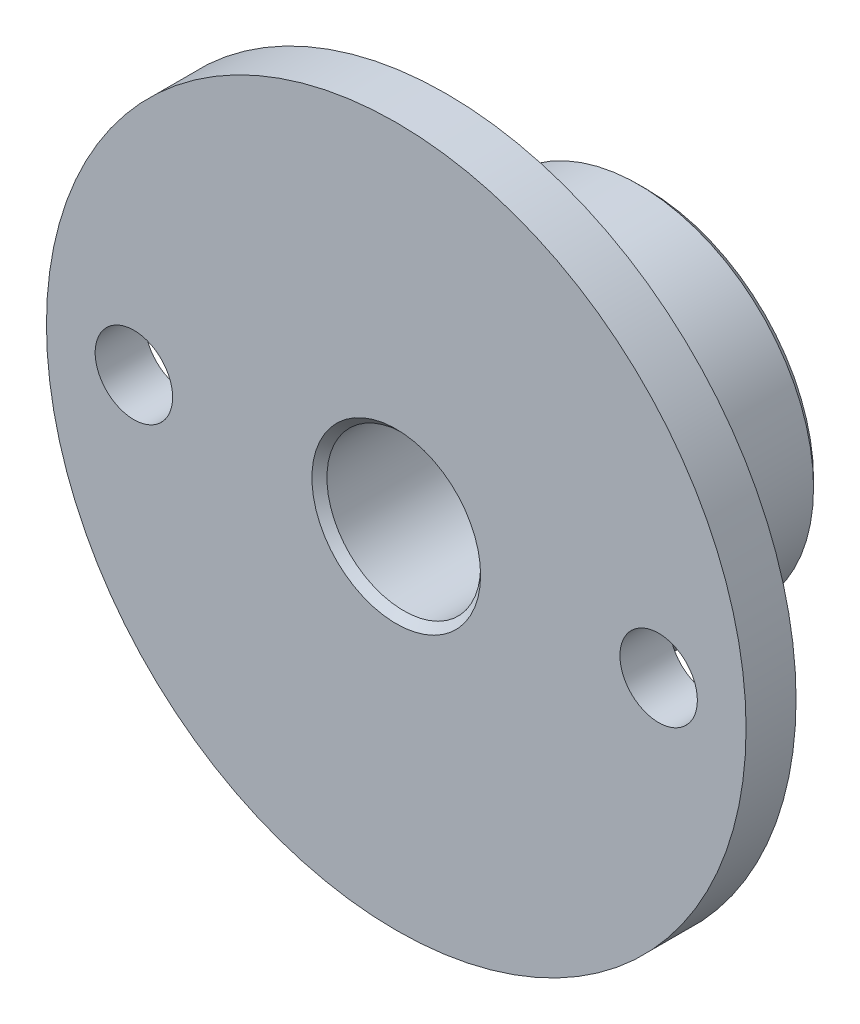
ISO-10303-21;
HEADER;
FILE_DESCRIPTION(('STEP AP214'),'2;1');
FILE_NAME('part.step','',(''),(''),'','','');
FILE_SCHEMA(('AUTOMOTIVE_DESIGN { 1 0 10303 214 1 1 1 1 }'));
ENDSEC;
DATA;
#1=APPLICATION_CONTEXT('core data for automotive mechanical design processes');
#2=APPLICATION_PROTOCOL_DEFINITION('international standard','automotive_design',2000,#1);
#3=PRODUCT_CONTEXT('',#1,'mechanical');
#4=PRODUCT('Part','Part','',(#3));
#5=PRODUCT_RELATED_PRODUCT_CATEGORY('part','',(#4));
#6=PRODUCT_DEFINITION_FORMATION('','',#4);
#7=PRODUCT_DEFINITION_CONTEXT('part definition',#1,'design');
#8=PRODUCT_DEFINITION('design','',#6,#7);
#9=PRODUCT_DEFINITION_SHAPE('','',#8);
#10=(LENGTH_UNIT() NAMED_UNIT(*) SI_UNIT(.MILLI.,.METRE.));
#11=(NAMED_UNIT(*) PLANE_ANGLE_UNIT() SI_UNIT($,.RADIAN.));
#12=(NAMED_UNIT(*) SI_UNIT($,.STERADIAN.) SOLID_ANGLE_UNIT());
#13=UNCERTAINTY_MEASURE_WITH_UNIT(LENGTH_MEASURE(1.E-05),#10,'distance_accuracy_value','');
#14=(GEOMETRIC_REPRESENTATION_CONTEXT(3) GLOBAL_UNCERTAINTY_ASSIGNED_CONTEXT((#13)) GLOBAL_UNIT_ASSIGNED_CONTEXT((#10,
#11,#12)) REPRESENTATION_CONTEXT('',''));
#15=CARTESIAN_POINT('',(0.,0.,0.));
#16=DIRECTION('',(0.,0.,1.));
#17=DIRECTION('',(1.,0.,0.));
#18=AXIS2_PLACEMENT_3D('',#15,#16,#17);
#19=CARTESIAN_POINT('',(0.,0.,8.));
#20=DIRECTION('',(0.,0.,-1.));
#21=DIRECTION('',(-1.,0.,0.));
#22=AXIS2_PLACEMENT_3D('',#19,#20,#21);
#23=CYLINDRICAL_SURFACE('',#22,7.);
#24=CARTESIAN_POINT('',(0.,0.,0.300000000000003));
#25=DIRECTION('',(0.,0.,1.));
#26=DIRECTION('',(1.,0.,0.));
#27=AXIS2_PLACEMENT_3D('',#24,#25,#26);
#28=CIRCLE('',#27,7.);
#29=CARTESIAN_POINT('',(7.,0.,0.300000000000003));
#30=VERTEX_POINT('',#29);
#31=EDGE_CURVE('E46',#30,#30,#28,.T.);
#32=ORIENTED_EDGE('',*,*,#31,.T.);
#33=EDGE_LOOP('',(#32));
#34=FACE_BOUND('',#33,.T.);
#35=CARTESIAN_POINT('',(0.,-7.,5.25));
#36=CARTESIAN_POINT('',(0.0696197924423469,-6.99999876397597,5.24999727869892));
#37=CARTESIAN_POINT('',(0.139275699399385,-6.99895060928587,5.24416404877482));
#38=CARTESIAN_POINT('',(0.276628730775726,-6.99487029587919,5.22099791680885));
#39=CARTESIAN_POINT('',(0.344324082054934,-6.99183639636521,5.20365492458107));
#40=CARTESIAN_POINT('',(0.475749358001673,-6.98412437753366,5.15801388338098));
#41=CARTESIAN_POINT('',(0.539482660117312,-6.97944768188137,5.1297253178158));
#42=CARTESIAN_POINT('',(0.661291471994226,-6.96896231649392,5.06302215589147));
#43=CARTESIAN_POINT('',(0.719367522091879,-6.96315375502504,5.02460852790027));
#44=CARTESIAN_POINT('',(0.828853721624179,-6.95097616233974,4.93830039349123));
#45=CARTESIAN_POINT('',(0.880193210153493,-6.94460221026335,4.89031693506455));
#46=CARTESIAN_POINT('',(0.974138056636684,-6.93204924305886,4.78642262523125));
#47=CARTESIAN_POINT('',(1.01674282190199,-6.92587024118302,4.73051123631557));
#48=CARTESIAN_POINT('',(1.09229802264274,-6.91435905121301,4.61185494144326));
#49=CARTESIAN_POINT('',(1.1251774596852,-6.90903321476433,4.54906415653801));
#50=CARTESIAN_POINT('',(1.17989439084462,-6.89990026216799,4.41873942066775));
#51=CARTESIAN_POINT('',(1.20173274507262,-6.89609302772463,4.35120583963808));
#52=CARTESIAN_POINT('',(1.23352263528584,-6.89047765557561,4.21406558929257));
#53=CARTESIAN_POINT('',(1.24359686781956,-6.88864889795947,4.1444882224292));
#54=CARTESIAN_POINT('',(1.25195320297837,-6.88713528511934,4.00460853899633));
#55=CARTESIAN_POINT('',(1.25023626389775,-6.88745025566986,3.93430628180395));
#56=CARTESIAN_POINT('',(1.23515868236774,-6.89016971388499,3.79585555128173));
#57=CARTESIAN_POINT('',(1.22193680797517,-6.8925492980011,3.72769140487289));
#58=CARTESIAN_POINT('',(1.18444287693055,-6.89909080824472,3.59456468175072));
#59=CARTESIAN_POINT('',(1.16017039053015,-6.90325280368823,3.52960222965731));
#60=CARTESIAN_POINT('',(1.1011263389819,-6.9129166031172,3.40431276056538));
#61=CARTESIAN_POINT('',(1.06629803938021,-6.91842561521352,3.34401305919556));
#62=CARTESIAN_POINT('',(0.987171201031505,-6.93015785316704,3.23006124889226));
#63=CARTESIAN_POINT('',(0.942871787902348,-6.93638114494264,3.17640975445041));
#64=CARTESIAN_POINT('',(0.845308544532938,-6.94894965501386,3.07647489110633));
#65=CARTESIAN_POINT('',(0.79192585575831,-6.95529534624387,3.03030754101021));
#66=CARTESIAN_POINT('',(0.678111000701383,-6.96731186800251,2.94756693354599));
#67=CARTESIAN_POINT('',(0.617678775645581,-6.97298269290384,2.91099375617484));
#68=CARTESIAN_POINT('',(0.491364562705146,-6.98302041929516,2.84846548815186));
#69=CARTESIAN_POINT('',(0.425476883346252,-6.98738593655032,2.82252165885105));
#70=CARTESIAN_POINT('',(0.290183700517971,-6.99431030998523,2.78210155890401));
#71=CARTESIAN_POINT('',(0.220778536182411,-6.99686933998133,2.76762418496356));
#72=CARTESIAN_POINT('',(0.0814194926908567,-6.9998687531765,2.75070757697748));
#73=CARTESIAN_POINT('',(0.0114855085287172,-7.00033713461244,2.74810924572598));
#74=CARTESIAN_POINT('',(-0.127817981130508,-6.99917952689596,2.75459886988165));
#75=CARTESIAN_POINT('',(-0.197187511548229,-6.99755363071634,2.76368630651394));
#76=CARTESIAN_POINT('',(-0.332894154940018,-6.99240754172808,2.79315719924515));
#77=CARTESIAN_POINT('',(-0.399249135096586,-6.98890072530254,2.81346091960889));
#78=CARTESIAN_POINT('',(-0.52761333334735,-6.98038436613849,2.86470231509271));
#79=CARTESIAN_POINT('',(-0.589622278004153,-6.97537472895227,2.8956406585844));
#80=CARTESIAN_POINT('',(-0.708218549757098,-6.96433866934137,2.96763061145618));
#81=CARTESIAN_POINT('',(-0.764745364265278,-6.95830256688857,3.0087803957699));
#82=CARTESIAN_POINT('',(-0.870148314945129,-6.94590984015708,3.09989132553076));
#83=CARTESIAN_POINT('',(-0.919023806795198,-6.93955318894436,3.14985321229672));
#84=CARTESIAN_POINT('',(-1.00833474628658,-6.92714394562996,3.25788748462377));
#85=CARTESIAN_POINT('',(-1.04866208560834,-6.92109590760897,3.31604985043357));
#86=CARTESIAN_POINT('',(-1.118974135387,-6.91007733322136,3.4384168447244));
#87=CARTESIAN_POINT('',(-1.14895920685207,-6.90510675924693,3.50262126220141));
#88=CARTESIAN_POINT('',(-1.19757853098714,-6.89684095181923,3.63496308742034));
#89=CARTESIAN_POINT('',(-1.21626421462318,-6.89353813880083,3.70308110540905));
#90=CARTESIAN_POINT('',(-1.24191447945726,-6.88896372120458,3.84155364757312));
#91=CARTESIAN_POINT('',(-1.24888024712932,-6.88769191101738,3.91190794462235));
#92=CARTESIAN_POINT('',(-1.25085614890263,-6.88733324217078,4.05177460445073));
#93=CARTESIAN_POINT('',(-1.24603664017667,-6.88821524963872,4.12128453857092));
#94=CARTESIAN_POINT('',(-1.22494973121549,-6.89199615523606,4.25848690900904));
#95=CARTESIAN_POINT('',(-1.20868238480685,-6.89489504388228,4.32617935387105));
#96=CARTESIAN_POINT('',(-1.16523056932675,-6.90237052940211,4.45774493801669));
#97=CARTESIAN_POINT('',(-1.13806288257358,-6.9069445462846,4.52162377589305));
#98=CARTESIAN_POINT('',(-1.07359967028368,-6.91725701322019,4.64394421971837));
#99=CARTESIAN_POINT('',(-1.03630352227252,-6.92299553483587,4.7023854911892));
#100=CARTESIAN_POINT('',(-0.952042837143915,-6.93508798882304,4.81302852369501));
#101=CARTESIAN_POINT('',(-0.904953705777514,-6.94144922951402,4.86513461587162));
#102=CARTESIAN_POINT('',(-0.802704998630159,-6.95401412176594,4.96076290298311));
#103=CARTESIAN_POINT('',(-0.747543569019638,-6.9602177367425,5.00428312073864));
#104=CARTESIAN_POINT('',(-0.630185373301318,-6.9718267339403,5.08182888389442));
#105=CARTESIAN_POINT('',(-0.56793551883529,-6.97722528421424,5.1157751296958));
#106=CARTESIAN_POINT('',(-0.438542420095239,-6.98654935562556,5.17267460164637));
#107=CARTESIAN_POINT('',(-0.371403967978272,-6.99047629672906,5.19563843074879));
#108=CARTESIAN_POINT('',(-0.253365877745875,-6.99558898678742,5.22511530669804));
#109=CARTESIAN_POINT('',(-0.203167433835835,-6.99723399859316,5.23443156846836));
#110=CARTESIAN_POINT('',(-0.10198577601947,-6.99943994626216,5.24687484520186));
#111=CARTESIAN_POINT('',(-0.0510025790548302,-7.00000090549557,5.25000199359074));
#112=CARTESIAN_POINT('',(0.,-7.,5.25));
#113=B_SPLINE_CURVE_WITH_KNOTS('',3,(#35,#36,#37,#38,#39,#40,#41,#42,#43,#44,#45,#46,#47,#48,
#49,#50,#51,#52,#53,#54,#55,#56,#57,#58,#59,#60,#61,#62,#63,#64,#65,#66,#67,#68,#69,#70,#71,#72,
#73,#74,#75,#76,#77,#78,#79,#80,#81,#82,#83,#84,#85,#86,#87,#88,#89,#90,#91,#92,#93,#94,#95,#96,
#97,#98,#99,#100,#101,#102,#103,#104,#105,#106,#107,#108,#109,#110,#111,#112),.UNSPECIFIED.,.T.,
.F.,(4,2,2,2,2,2,2,2,2,2,2,2,2,2,2,2,2,2,2,2,2,2,2,2,2,2,2,2,2,2,2,2,2,2,2,2,2,2,4),(0.,
0.208672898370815,0.417528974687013,0.626204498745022,0.834860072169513,1.04555398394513,
1.2562621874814,1.46847268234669,1.68066664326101,1.89062713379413,2.10057056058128,
2.30801629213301,2.51547009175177,2.72405928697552,2.93266774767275,3.14425188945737,
3.35583779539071,3.56764729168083,3.77943640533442,3.98838053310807,4.1973153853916,
4.40478370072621,4.61226505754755,4.82182420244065,5.03140098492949,5.24348810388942,
5.45556781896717,5.66667480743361,5.87776042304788,6.08581286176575,6.29386432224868,
6.50159668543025,6.70934181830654,6.91991234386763,7.13053130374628,7.34284672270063,
7.5549567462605,7.70783116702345,7.8607022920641),.UNSPECIFIED.);
#114=CARTESIAN_POINT('',(0.,-7.,5.25));
#115=VERTEX_POINT('',#114);
#116=EDGE_CURVE('E69',#115,#115,#113,.T.);
#117=ORIENTED_EDGE('',*,*,#116,.T.);
#118=EDGE_LOOP('',(#117));
#119=FACE_BOUND('',#118,.T.);
#120=CARTESIAN_POINT('',(0.,0.,8.));
#121=DIRECTION('',(0.,0.,1.));
#122=DIRECTION('',(1.,0.,0.));
#123=AXIS2_PLACEMENT_3D('',#120,#121,#122);
#124=CIRCLE('',#123,7.);
#125=CARTESIAN_POINT('',(7.,0.,8.));
#126=VERTEX_POINT('',#125);
#127=EDGE_CURVE('E61',#126,#126,#124,.T.);
#128=ORIENTED_EDGE('',*,*,#127,.F.);
#129=EDGE_LOOP('',(#128));
#130=FACE_BOUND('',#129,.T.);
#131=ADVANCED_FACE('F35',(#34,#119,#130),#23,.T.);
#132=CARTESIAN_POINT('',(0.,0.,0.));
#133=DIRECTION('',(0.,0.,1.));
#134=DIRECTION('',(1.,0.,0.));
#135=AXIS2_PLACEMENT_3D('',#132,#133,#134);
#136=PLANE('',#135);
#137=CARTESIAN_POINT('',(0.,0.,0.));
#138=DIRECTION('',(0.,0.,1.));
#139=DIRECTION('',(1.,0.,0.));
#140=AXIS2_PLACEMENT_3D('',#137,#138,#139);
#141=CIRCLE('',#140,6.7);
#142=CARTESIAN_POINT('',(6.7,0.,0.));
#143=VERTEX_POINT('',#142);
#144=EDGE_CURVE('E10',#143,#143,#141,.F.);
#145=ORIENTED_EDGE('',*,*,#144,.T.);
#146=EDGE_LOOP('',(#145));
#147=FACE_BOUND('',#146,.T.);
#148=CARTESIAN_POINT('',(0.,0.,0.));
#149=DIRECTION('',(0.,0.,1.));
#150=DIRECTION('',(1.,0.,0.));
#151=AXIS2_PLACEMENT_3D('',#148,#149,#150);
#152=CIRCLE('',#151,3.375);
#153=CARTESIAN_POINT('',(3.375,0.,0.));
#154=VERTEX_POINT('',#153);
#155=EDGE_CURVE('E42',#154,#154,#152,.T.);
#156=ORIENTED_EDGE('',*,*,#155,.T.);
#157=EDGE_LOOP('',(#156));
#158=FACE_BOUND('',#157,.T.);
#159=ADVANCED_FACE('F95',(#147,#158),#136,.F.);
#160=CARTESIAN_POINT('',(0.,0.,8.));
#161=DIRECTION('',(0.,0.,1.));
#162=DIRECTION('',(1.,0.,0.));
#163=AXIS2_PLACEMENT_3D('',#160,#161,#162);
#164=PLANE('',#163);
#165=CARTESIAN_POINT('',(10.5,0.,8.));
#166=DIRECTION('',(0.,0.,1.));
#167=DIRECTION('',(1.,0.,0.));
#168=AXIS2_PLACEMENT_3D('',#165,#166,#167);
#169=CIRCLE('',#168,1.55);
#170=CARTESIAN_POINT('',(12.05,0.,8.));
#171=VERTEX_POINT('',#170);
#172=EDGE_CURVE('E128',#171,#171,#169,.T.);
#173=ORIENTED_EDGE('',*,*,#172,.T.);
#174=EDGE_LOOP('',(#173));
#175=FACE_BOUND('',#174,.T.);
#176=CARTESIAN_POINT('',(-10.5,0.,8.));
#177=DIRECTION('',(0.,0.,1.));
#178=DIRECTION('',(1.,0.,0.));
#179=AXIS2_PLACEMENT_3D('',#176,#177,#178);
#180=CIRCLE('',#179,1.55);
#181=CARTESIAN_POINT('',(-8.95,0.,8.));
#182=VERTEX_POINT('',#181);
#183=EDGE_CURVE('E122',#182,#182,#180,.T.);
#184=ORIENTED_EDGE('',*,*,#183,.T.);
#185=EDGE_LOOP('',(#184));
#186=FACE_BOUND('',#185,.T.);
#187=CARTESIAN_POINT('',(0.,0.,8.));
#188=DIRECTION('',(0.,0.,1.));
#189=DIRECTION('',(1.,0.,0.));
#190=AXIS2_PLACEMENT_3D('',#187,#188,#189);
#191=CIRCLE('',#190,14.);
#192=CARTESIAN_POINT('',(14.,0.,8.));
#193=VERTEX_POINT('',#192);
#194=EDGE_CURVE('E117',#193,#193,#191,.T.);
#195=ORIENTED_EDGE('',*,*,#194,.F.);
#196=EDGE_LOOP('',(#195));
#197=FACE_BOUND('',#196,.T.);
#198=ORIENTED_EDGE('',*,*,#127,.T.);
#199=EDGE_LOOP('',(#198));
#200=FACE_BOUND('',#199,.T.);
#201=ADVANCED_FACE('F149',(#175,#186,#197,#200),#164,.F.);
#202=CARTESIAN_POINT('',(0.,0.,10.));
#203=DIRECTION('',(0.,0.,-1.));
#204=DIRECTION('',(-1.,0.,0.));
#205=AXIS2_PLACEMENT_3D('',#202,#203,#204);
#206=CYLINDRICAL_SURFACE('',#205,14.);
#207=CARTESIAN_POINT('',(0.,0.,10.));
#208=DIRECTION('',(0.,0.,1.));
#209=DIRECTION('',(1.,0.,0.));
#210=AXIS2_PLACEMENT_3D('',#207,#208,#209);
#211=CIRCLE('',#210,14.);
#212=CARTESIAN_POINT('',(14.,0.,10.));
#213=VERTEX_POINT('',#212);
#214=EDGE_CURVE('E115',#213,#213,#211,.T.);
#215=ORIENTED_EDGE('',*,*,#214,.F.);
#216=EDGE_LOOP('',(#215));
#217=FACE_BOUND('',#216,.T.);
#218=ORIENTED_EDGE('',*,*,#194,.T.);
#219=EDGE_LOOP('',(#218));
#220=FACE_BOUND('',#219,.T.);
#221=ADVANCED_FACE('F140',(#217,#220),#206,.T.);
#222=CARTESIAN_POINT('',(0.,0.,10.));
#223=DIRECTION('',(0.,0.,1.));
#224=DIRECTION('',(1.,0.,0.));
#225=AXIS2_PLACEMENT_3D('',#222,#223,#224);
#226=PLANE('',#225);
#227=CARTESIAN_POINT('',(0.,0.,10.));
#228=DIRECTION('',(0.,0.,1.));
#229=DIRECTION('',(1.,0.,0.));
#230=AXIS2_PLACEMENT_3D('',#227,#228,#229);
#231=CIRCLE('',#230,3.37500000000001);
#232=CARTESIAN_POINT('',(3.37500000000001,0.,10.));
#233=VERTEX_POINT('',#232);
#234=EDGE_CURVE('E50',#233,#233,#231,.F.);
#235=ORIENTED_EDGE('',*,*,#234,.T.);
#236=EDGE_LOOP('',(#235));
#237=FACE_BOUND('',#236,.T.);
#238=CARTESIAN_POINT('',(10.5,0.,10.));
#239=DIRECTION('',(0.,0.,1.));
#240=DIRECTION('',(1.,0.,0.));
#241=AXIS2_PLACEMENT_3D('',#238,#239,#240);
#242=CIRCLE('',#241,1.55);
#243=CARTESIAN_POINT('',(12.05,0.,10.));
#244=VERTEX_POINT('',#243);
#245=EDGE_CURVE('E89',#244,#244,#242,.T.);
#246=ORIENTED_EDGE('',*,*,#245,.F.);
#247=EDGE_LOOP('',(#246));
#248=FACE_BOUND('',#247,.T.);
#249=CARTESIAN_POINT('',(-10.5,0.,10.));
#250=DIRECTION('',(0.,0.,1.));
#251=DIRECTION('',(1.,0.,0.));
#252=AXIS2_PLACEMENT_3D('',#249,#250,#251);
#253=CIRCLE('',#252,1.55);
#254=CARTESIAN_POINT('',(-8.95,0.,10.));
#255=VERTEX_POINT('',#254);
#256=EDGE_CURVE('E126',#255,#255,#253,.T.);
#257=ORIENTED_EDGE('',*,*,#256,.F.);
#258=EDGE_LOOP('',(#257));
#259=FACE_BOUND('',#258,.T.);
#260=ORIENTED_EDGE('',*,*,#214,.T.);
#261=EDGE_LOOP('',(#260));
#262=FACE_BOUND('',#261,.T.);
#263=ADVANCED_FACE('F137',(#237,#248,#259,#262),#226,.T.);
#264=CARTESIAN_POINT('',(0.,0.,0.));
#265=DIRECTION('',(0.,0.,1.));
#266=DIRECTION('',(1.,0.,0.));
#267=AXIS2_PLACEMENT_3D('',#264,#265,#266);
#268=CYLINDRICAL_SURFACE('',#267,3.075);
#269=CARTESIAN_POINT('',(0.,0.,9.69999999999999));
#270=DIRECTION('',(0.,0.,1.));
#271=DIRECTION('',(1.,0.,0.));
#272=AXIS2_PLACEMENT_3D('',#269,#270,#271);
#273=CIRCLE('',#272,3.075);
#274=CARTESIAN_POINT('',(3.075,0.,9.69999999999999));
#275=VERTEX_POINT('',#274);
#276=EDGE_CURVE('E55',#275,#275,#273,.T.);
#277=ORIENTED_EDGE('',*,*,#276,.T.);
#278=EDGE_LOOP('',(#277));
#279=FACE_BOUND('',#278,.T.);
#280=CARTESIAN_POINT('',(0.,0.,0.300000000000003));
#281=DIRECTION('',(0.,0.,1.));
#282=DIRECTION('',(1.,0.,0.));
#283=AXIS2_PLACEMENT_3D('',#280,#281,#282);
#284=CIRCLE('',#283,3.075);
#285=CARTESIAN_POINT('',(3.075,0.,0.300000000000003));
#286=VERTEX_POINT('',#285);
#287=EDGE_CURVE('E58',#286,#286,#284,.F.);
#288=ORIENTED_EDGE('',*,*,#287,.T.);
#289=EDGE_LOOP('',(#288));
#290=FACE_BOUND('',#289,.T.);
#291=CARTESIAN_POINT('',(0.,-3.075,5.25));
#292=CARTESIAN_POINT('',(-0.0670960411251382,-3.07499507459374,5.24999338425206));
#293=CARTESIAN_POINT('',(-0.134304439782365,-3.07277831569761,5.24456556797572));
#294=CARTESIAN_POINT('',(-0.266822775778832,-3.06412620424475,5.22304401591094));
#295=CARTESIAN_POINT('',(-0.332127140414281,-3.05767955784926,5.20692172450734));
#296=CARTESIAN_POINT('',(-0.458705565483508,-3.04126163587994,5.16469875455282));
#297=CARTESIAN_POINT('',(-0.519992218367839,-3.03130206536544,5.13863119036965));
#298=CARTESIAN_POINT('',(-0.637265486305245,-3.00883490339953,5.07739105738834));
#299=CARTESIAN_POINT('',(-0.693253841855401,-2.99632815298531,5.04222149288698));
#300=CARTESIAN_POINT('',(-0.801130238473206,-2.969350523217,4.96198024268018));
#301=CARTESIAN_POINT('',(-0.85272874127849,-2.95481736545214,4.91654040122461));
#302=CARTESIAN_POINT('',(-0.947819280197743,-2.92570360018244,4.817826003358));
#303=CARTESIAN_POINT('',(-0.991307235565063,-2.91112297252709,4.76454752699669));
#304=CARTESIAN_POINT('',(-1.07092779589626,-2.88281270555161,4.64867452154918));
#305=CARTESIAN_POINT('',(-1.10662661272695,-2.8691537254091,4.58576286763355));
#306=CARTESIAN_POINT('',(-1.16680627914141,-2.84521438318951,4.45419044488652));
#307=CARTESIAN_POINT('',(-1.19129263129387,-2.83493236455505,4.38553251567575));
#308=CARTESIAN_POINT('',(-1.22717171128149,-2.81958182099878,4.24774611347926));
#309=CARTESIAN_POINT('',(-1.23911994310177,-2.81429325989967,4.17878772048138));
#310=CARTESIAN_POINT('',(-1.25131810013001,-2.80889252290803,4.03965760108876));
#311=CARTESIAN_POINT('',(-1.2515740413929,-2.80877768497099,3.9694865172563));
#312=CARTESIAN_POINT('',(-1.24080032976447,-2.81355023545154,3.8353349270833));
#313=CARTESIAN_POINT('',(-1.23058524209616,-2.81807658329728,3.77127363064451));
#314=CARTESIAN_POINT('',(-1.20052077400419,-2.83101392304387,3.64586829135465));
#315=CARTESIAN_POINT('',(-1.18066965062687,-2.83942561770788,3.58452474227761));
#316=CARTESIAN_POINT('',(-1.13151479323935,-2.8593727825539,3.46478868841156));
#317=CARTESIAN_POINT('',(-1.10202336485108,-2.87096948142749,3.40648389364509));
#318=CARTESIAN_POINT('',(-1.03455716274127,-2.89596416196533,3.295431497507));
#319=CARTESIAN_POINT('',(-0.996579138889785,-2.90936283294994,3.24268603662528));
#320=CARTESIAN_POINT('',(-0.909645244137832,-2.93775785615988,3.13980499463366));
#321=CARTESIAN_POINT('',(-0.860053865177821,-2.95279623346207,3.0902165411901));
#322=CARTESIAN_POINT('',(-0.75310293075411,-2.98186678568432,2.99988158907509));
#323=CARTESIAN_POINT('',(-0.695741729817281,-2.99589874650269,2.95913696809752));
#324=CARTESIAN_POINT('',(-0.573284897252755,-3.02174804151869,2.88689611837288));
#325=CARTESIAN_POINT('',(-0.508052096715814,-3.03351265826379,2.85561216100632));
#326=CARTESIAN_POINT('',(-0.372649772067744,-3.05310086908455,2.80465190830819));
#327=CARTESIAN_POINT('',(-0.302482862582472,-3.06092653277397,2.78496951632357));
#328=CARTESIAN_POINT('',(-0.163784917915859,-3.07137426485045,2.75889250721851));
#329=CARTESIAN_POINT('',(-0.0954136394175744,-3.07428368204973,2.75176301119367));
#330=CARTESIAN_POINT('',(0.0416040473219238,-3.075480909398,2.74881614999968));
#331=CARTESIAN_POINT('',(0.11025037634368,-3.07376996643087,2.75299573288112));
#332=CARTESIAN_POINT('',(0.242496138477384,-3.06610619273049,2.77201340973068));
#333=CARTESIAN_POINT('',(0.306181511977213,-3.06035531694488,2.78634431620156));
#334=CARTESIAN_POINT('',(0.430180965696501,-3.0454018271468,2.82456165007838));
#335=CARTESIAN_POINT('',(0.490494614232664,-3.03619877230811,2.84844929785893));
#336=CARTESIAN_POINT('',(0.608131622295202,-3.01487748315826,2.90588278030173));
#337=CARTESIAN_POINT('',(0.665305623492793,-3.00267817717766,2.93970347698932));
#338=CARTESIAN_POINT('',(0.773369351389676,-2.97667917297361,3.01573928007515));
#339=CARTESIAN_POINT('',(0.824256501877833,-2.96287882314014,3.05795780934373));
#340=CARTESIAN_POINT('',(0.921942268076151,-2.934010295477,3.15296145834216));
#341=CARTESIAN_POINT('',(0.968226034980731,-2.9189198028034,3.2062705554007));
#342=CARTESIAN_POINT('',(1.05132389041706,-2.89003174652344,3.32015620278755));
#343=CARTESIAN_POINT('',(1.0881361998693,-2.87623442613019,3.38073411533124));
#344=CARTESIAN_POINT('',(1.15153996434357,-2.85144843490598,3.50847731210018));
#345=CARTESIAN_POINT('',(1.17801033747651,-2.84049351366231,3.57570971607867));
#346=CARTESIAN_POINT('',(1.21904126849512,-2.82313108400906,3.71425957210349));
#347=CARTESIAN_POINT('',(1.23361101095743,-2.81672006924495,3.78557382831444));
#348=CARTESIAN_POINT('',(1.24953583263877,-2.80968930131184,3.92458095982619));
#349=CARTESIAN_POINT('',(1.2517883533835,-2.80867639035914,3.99215171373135));
#350=CARTESIAN_POINT('',(1.24538665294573,-2.81152084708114,4.12666321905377));
#351=CARTESIAN_POINT('',(1.23673392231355,-2.81537754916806,4.19360405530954));
#352=CARTESIAN_POINT('',(1.20950856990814,-2.82717494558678,4.32205598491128));
#353=CARTESIAN_POINT('',(1.19136977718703,-2.83493650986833,4.38367700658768));
#354=CARTESIAN_POINT('',(1.14610002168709,-2.8535373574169,4.50302189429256));
#355=CARTESIAN_POINT('',(1.11896655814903,-2.86437749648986,4.56074467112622));
#356=CARTESIAN_POINT('',(1.0546486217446,-2.8886999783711,4.67433056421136));
#357=CARTESIAN_POINT('',(1.01696961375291,-2.90229967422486,4.72988808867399));
#358=CARTESIAN_POINT('',(0.933341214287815,-2.9302630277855,4.83417318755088));
#359=CARTESIAN_POINT('',(0.887389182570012,-2.94462692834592,4.88289857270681));
#360=CARTESIAN_POINT('',(0.784809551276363,-2.97367207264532,4.97553402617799));
#361=CARTESIAN_POINT('',(0.72766900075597,-2.98830866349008,5.01889265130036));
#362=CARTESIAN_POINT('',(0.606372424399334,-3.01525973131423,5.09542366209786));
#363=CARTESIAN_POINT('',(0.542213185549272,-3.02757313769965,5.12859135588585));
#364=CARTESIAN_POINT('',(0.409812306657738,-3.04829296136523,5.18304205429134));
#365=CARTESIAN_POINT('',(0.341664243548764,-3.05676533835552,5.20452707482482));
#366=CARTESIAN_POINT('',(0.20243415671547,-3.06911885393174,5.23554609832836));
#367=CARTESIAN_POINT('',(0.131362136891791,-3.07301448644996,5.24511783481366));
#368=CARTESIAN_POINT('',(0.0400674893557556,-3.07480565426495,5.24952039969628));
#369=CARTESIAN_POINT('',(0.0200387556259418,-3.07500147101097,5.25000197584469));
#370=CARTESIAN_POINT('',(0.,-3.075,5.25));
#371=B_SPLINE_CURVE_WITH_KNOTS('',3,(#291,#292,#293,#294,#295,#296,#297,#298,#299,#300,#301,
#302,#303,#304,#305,#306,#307,#308,#309,#310,#311,#312,#313,#314,#315,#316,#317,#318,#319,#320,
#321,#322,#323,#324,#325,#326,#327,#328,#329,#330,#331,#332,#333,#334,#335,#336,#337,#338,#339,
#340,#341,#342,#343,#344,#345,#346,#347,#348,#349,#350,#351,#352,#353,#354,#355,#356,#357,#358,
#359,#360,#361,#362,#363,#364,#365,#366,#367,#368,#369,#370),.UNSPECIFIED.,.T.,.F.,(4,2,2,2,2,2,
2,2,2,2,2,2,2,2,2,2,2,2,2,2,2,2,2,2,2,2,2,2,2,2,2,2,2,2,2,2,2,2,2,4),(0.,0.201233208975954,
0.403005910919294,0.604112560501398,0.805152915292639,1.01505531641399,1.22506304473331,
1.44479432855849,1.66441766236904,1.87383671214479,2.08314800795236,2.27732694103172,
2.47154101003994,2.66978726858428,2.86810958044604,3.08231142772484,3.29655870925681,
3.51530687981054,3.73393999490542,3.9392854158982,4.14457542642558,4.34027245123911,
4.53599447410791,4.73774594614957,4.93957981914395,5.15516635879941,5.37079336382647,
5.58887422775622,5.80678662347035,6.00858649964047,6.21035879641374,6.40362008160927,
6.59693514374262,6.80154251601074,7.00621530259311,7.22478249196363,7.44345015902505,
7.65820557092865,7.87227903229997,7.93237889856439),.UNSPECIFIED.);
#372=CARTESIAN_POINT('',(0.,-3.075,5.25));
#373=VERTEX_POINT('',#372);
#374=EDGE_CURVE('E62',#373,#373,#371,.T.);
#375=ORIENTED_EDGE('',*,*,#374,.T.);
#376=EDGE_LOOP('',(#375));
#377=FACE_BOUND('',#376,.T.);
#378=ADVANCED_FACE('F71',(#279,#290,#377),#268,.F.);
#379=CARTESIAN_POINT('',(-10.5,0.,0.));
#380=DIRECTION('',(0.,0.,1.));
#381=DIRECTION('',(1.,0.,0.));
#382=AXIS2_PLACEMENT_3D('',#379,#380,#381);
#383=CYLINDRICAL_SURFACE('',#382,1.55);
#384=ORIENTED_EDGE('',*,*,#256,.T.);
#385=EDGE_LOOP('',(#384));
#386=FACE_BOUND('',#385,.T.);
#387=ORIENTED_EDGE('',*,*,#183,.F.);
#388=EDGE_LOOP('',(#387));
#389=FACE_BOUND('',#388,.T.);
#390=ADVANCED_FACE('F144',(#386,#389),#383,.F.);
#391=CARTESIAN_POINT('',(10.5,0.,0.));
#392=DIRECTION('',(0.,0.,1.));
#393=DIRECTION('',(1.,0.,0.));
#394=AXIS2_PLACEMENT_3D('',#391,#392,#393);
#395=CYLINDRICAL_SURFACE('',#394,1.55);
#396=ORIENTED_EDGE('',*,*,#245,.T.);
#397=EDGE_LOOP('',(#396));
#398=FACE_BOUND('',#397,.T.);
#399=ORIENTED_EDGE('',*,*,#172,.F.);
#400=EDGE_LOOP('',(#399));
#401=FACE_BOUND('',#400,.T.);
#402=ADVANCED_FACE('F80',(#398,#401),#395,.F.);
#403=CARTESIAN_POINT('',(0.,-10.,4.));
#404=DIRECTION('',(0.,1.,0.));
#405=DIRECTION('',(0.,0.,1.));
#406=AXIS2_PLACEMENT_3D('',#403,#404,#405);
#407=CYLINDRICAL_SURFACE('',#406,1.25);
#408=ORIENTED_EDGE('',*,*,#374,.F.);
#409=EDGE_LOOP('',(#408));
#410=FACE_BOUND('',#409,.T.);
#411=ORIENTED_EDGE('',*,*,#116,.F.);
#412=EDGE_LOOP('',(#411));
#413=FACE_BOUND('',#412,.T.);
#414=ADVANCED_FACE('F75',(#410,#413),#407,.F.);
#415=CARTESIAN_POINT('',(0.,0.,9.69999999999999));
#416=DIRECTION('',(0.,0.,1.));
#417=DIRECTION('',(1.,0.,0.));
#418=AXIS2_PLACEMENT_3D('',#415,#416,#417);
#419=CONICAL_SURFACE('',#418,3.075,0.785398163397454);
#420=ORIENTED_EDGE('',*,*,#234,.F.);
#421=EDGE_LOOP('',(#420));
#422=FACE_BOUND('',#421,.T.);
#423=ORIENTED_EDGE('',*,*,#276,.F.);
#424=EDGE_LOOP('',(#423));
#425=FACE_BOUND('',#424,.T.);
#426=ADVANCED_FACE('F79',(#422,#425),#419,.F.);
#427=CARTESIAN_POINT('',(0.,0.,0.300000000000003));
#428=DIRECTION('',(0.,0.,1.));
#429=DIRECTION('',(1.,0.,0.));
#430=AXIS2_PLACEMENT_3D('',#427,#428,#429);
#431=CONICAL_SURFACE('',#430,7.,0.785398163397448);
#432=ORIENTED_EDGE('',*,*,#144,.F.);
#433=EDGE_LOOP('',(#432));
#434=FACE_BOUND('',#433,.T.);
#435=ORIENTED_EDGE('',*,*,#31,.F.);
#436=EDGE_LOOP('',(#435));
#437=FACE_BOUND('',#436,.T.);
#438=ADVANCED_FACE('F99',(#434,#437),#431,.T.);
#439=CARTESIAN_POINT('',(0.,0.,0.));
#440=DIRECTION('',(0.,0.,-1.));
#441=DIRECTION('',(-1.,0.,0.));
#442=AXIS2_PLACEMENT_3D('',#439,#440,#441);
#443=CONICAL_SURFACE('',#442,3.375,0.785398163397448);
#444=ORIENTED_EDGE('',*,*,#287,.F.);
#445=EDGE_LOOP('',(#444));
#446=FACE_BOUND('',#445,.T.);
#447=ORIENTED_EDGE('',*,*,#155,.F.);
#448=EDGE_LOOP('',(#447));
#449=FACE_BOUND('',#448,.T.);
#450=ADVANCED_FACE('F37',(#446,#449),#443,.F.);
#451=CLOSED_SHELL('',(#131,#159,#201,#221,#263,#378,#390,#402,#414,#426,#438,#450));
#452=MANIFOLD_SOLID_BREP('B2',#451);
#453=ADVANCED_BREP_SHAPE_REPRESENTATION('',(#18,#452),#14);
#454=SHAPE_DEFINITION_REPRESENTATION(#9,#453);
ENDSEC;
END-ISO-10303-21;
